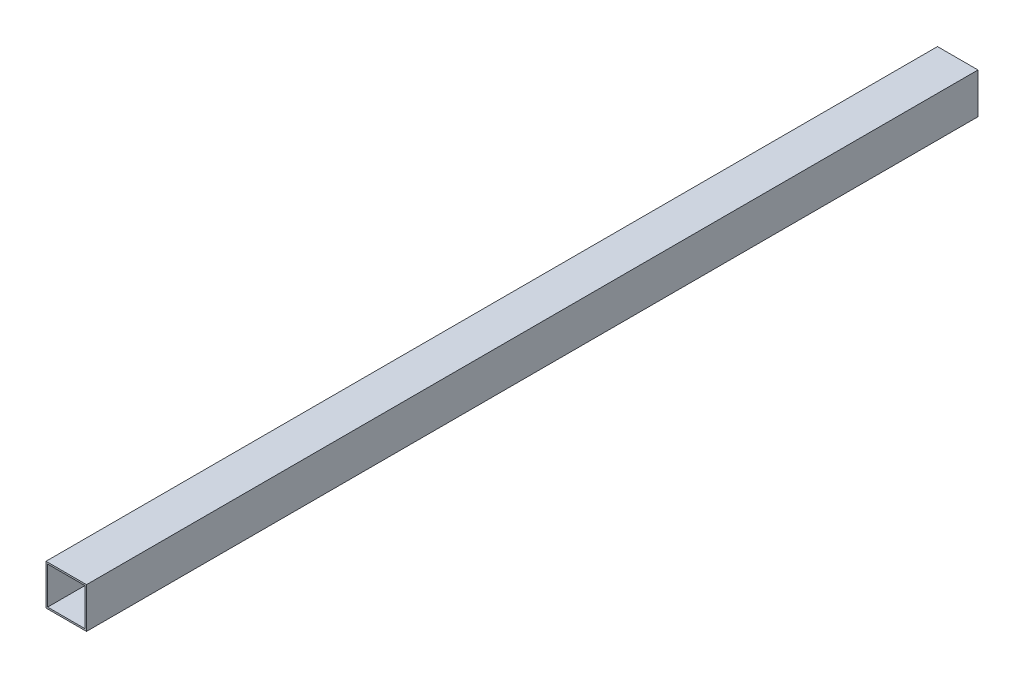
ISO-10303-21;
HEADER;
FILE_DESCRIPTION(('STEP AP214'),'2;1');
FILE_NAME('part.step','',(''),(''),'','','');
FILE_SCHEMA(('AUTOMOTIVE_DESIGN { 1 0 10303 214 1 1 1 1 }'));
ENDSEC;
DATA;
#1=APPLICATION_CONTEXT('core data for automotive mechanical design processes');
#2=APPLICATION_PROTOCOL_DEFINITION('international standard','automotive_design',2000,#1);
#3=PRODUCT_CONTEXT('',#1,'mechanical');
#4=PRODUCT('Part','Part','',(#3));
#5=PRODUCT_RELATED_PRODUCT_CATEGORY('part','',(#4));
#6=PRODUCT_DEFINITION_FORMATION('','',#4);
#7=PRODUCT_DEFINITION_CONTEXT('part definition',#1,'design');
#8=PRODUCT_DEFINITION('design','',#6,#7);
#9=PRODUCT_DEFINITION_SHAPE('','',#8);
#10=(LENGTH_UNIT() NAMED_UNIT(*) SI_UNIT(.MILLI.,.METRE.));
#11=(NAMED_UNIT(*) PLANE_ANGLE_UNIT() SI_UNIT($,.RADIAN.));
#12=(NAMED_UNIT(*) SI_UNIT($,.STERADIAN.) SOLID_ANGLE_UNIT());
#13=UNCERTAINTY_MEASURE_WITH_UNIT(LENGTH_MEASURE(1.E-05),#10,'distance_accuracy_value','');
#14=(GEOMETRIC_REPRESENTATION_CONTEXT(3) GLOBAL_UNCERTAINTY_ASSIGNED_CONTEXT((#13)) GLOBAL_UNIT_ASSIGNED_CONTEXT((#10,
#11,#12)) REPRESENTATION_CONTEXT('',''));
#15=CARTESIAN_POINT('',(0.,0.,0.));
#16=DIRECTION('',(0.,0.,1.));
#17=DIRECTION('',(1.,0.,0.));
#18=AXIS2_PLACEMENT_3D('',#15,#16,#17);
#19=CARTESIAN_POINT('',(0.,0.,1100.));
#20=DIRECTION('',(0.,0.,1.));
#21=DIRECTION('',(1.,0.,0.));
#22=AXIS2_PLACEMENT_3D('',#19,#20,#21);
#23=PLANE('',#22);
#24=DIRECTION('',(0.,1.,0.));
#25=VECTOR('',#24,1.);
#26=CARTESIAN_POINT('',(25.,-25.,1100.));
#27=LINE('',#26,#25);
#28=CARTESIAN_POINT('',(25.,-25.,1100.));
#29=VERTEX_POINT('',#28);
#30=CARTESIAN_POINT('',(25.,25.,1100.));
#31=VERTEX_POINT('',#30);
#32=EDGE_CURVE('E164',#29,#31,#27,.T.);
#33=ORIENTED_EDGE('',*,*,#32,.T.);
#34=DIRECTION('',(-1.,0.,0.));
#35=VECTOR('',#34,1.);
#36=CARTESIAN_POINT('',(-25.,25.,1100.));
#37=LINE('',#36,#35);
#38=CARTESIAN_POINT('',(-25.,25.,1100.));
#39=VERTEX_POINT('',#38);
#40=EDGE_CURVE('E167',#31,#39,#37,.T.);
#41=ORIENTED_EDGE('',*,*,#40,.T.);
#42=DIRECTION('',(0.,-1.,0.));
#43=VECTOR('',#42,1.);
#44=CARTESIAN_POINT('',(-25.,-25.,1100.));
#45=LINE('',#44,#43);
#46=CARTESIAN_POINT('',(-25.,-25.,1100.));
#47=VERTEX_POINT('',#46);
#48=EDGE_CURVE('E170',#39,#47,#45,.T.);
#49=ORIENTED_EDGE('',*,*,#48,.T.);
#50=DIRECTION('',(1.,0.,0.));
#51=VECTOR('',#50,1.);
#52=CARTESIAN_POINT('',(-25.,-25.,1100.));
#53=LINE('',#52,#51);
#54=EDGE_CURVE('E172',#47,#29,#53,.T.);
#55=ORIENTED_EDGE('',*,*,#54,.T.);
#56=EDGE_LOOP('',(#33,#41,#49,#55));
#57=FACE_BOUND('',#56,.T.);
#58=DIRECTION('',(-1.,0.,0.));
#59=VECTOR('',#58,1.);
#60=CARTESIAN_POINT('',(0.,23.,1100.));
#61=LINE('',#60,#59);
#62=CARTESIAN_POINT('',(23.,23.,1100.));
#63=VERTEX_POINT('',#62);
#64=CARTESIAN_POINT('',(-23.,23.,1100.));
#65=VERTEX_POINT('',#64);
#66=EDGE_CURVE('E136',#63,#65,#61,.T.);
#67=ORIENTED_EDGE('',*,*,#66,.F.);
#68=DIRECTION('',(0.,1.,0.));
#69=VECTOR('',#68,1.);
#70=CARTESIAN_POINT('',(23.,0.,1100.));
#71=LINE('',#70,#69);
#72=CARTESIAN_POINT('',(23.,-23.,1100.));
#73=VERTEX_POINT('',#72);
#74=EDGE_CURVE('E128',#73,#63,#71,.T.);
#75=ORIENTED_EDGE('',*,*,#74,.F.);
#76=DIRECTION('',(1.,0.,0.));
#77=VECTOR('',#76,1.);
#78=CARTESIAN_POINT('',(0.,-23.,1100.));
#79=LINE('',#78,#77);
#80=CARTESIAN_POINT('',(-23.,-23.,1100.));
#81=VERTEX_POINT('',#80);
#82=EDGE_CURVE('E150',#81,#73,#79,.T.);
#83=ORIENTED_EDGE('',*,*,#82,.F.);
#84=DIRECTION('',(0.,-1.,0.));
#85=VECTOR('',#84,1.);
#86=CARTESIAN_POINT('',(-23.,0.,1100.));
#87=LINE('',#86,#85);
#88=EDGE_CURVE('E148',#65,#81,#87,.T.);
#89=ORIENTED_EDGE('',*,*,#88,.F.);
#90=EDGE_LOOP('',(#67,#75,#83,#89));
#91=FACE_BOUND('',#90,.T.);
#92=ADVANCED_FACE('F63',(#57,#91),#23,.T.);
#93=CARTESIAN_POINT('',(0.,0.,0.));
#94=DIRECTION('',(0.,0.,1.));
#95=DIRECTION('',(1.,0.,0.));
#96=AXIS2_PLACEMENT_3D('',#93,#94,#95);
#97=PLANE('',#96);
#98=DIRECTION('',(0.,1.,0.));
#99=VECTOR('',#98,1.);
#100=CARTESIAN_POINT('',(25.,-25.,0.));
#101=LINE('',#100,#99);
#102=CARTESIAN_POINT('',(25.,-25.,0.));
#103=VERTEX_POINT('',#102);
#104=CARTESIAN_POINT('',(25.,25.,0.));
#105=VERTEX_POINT('',#104);
#106=EDGE_CURVE('E144',#103,#105,#101,.T.);
#107=ORIENTED_EDGE('',*,*,#106,.F.);
#108=DIRECTION('',(1.,0.,0.));
#109=VECTOR('',#108,1.);
#110=CARTESIAN_POINT('',(-25.,-25.,0.));
#111=LINE('',#110,#109);
#112=CARTESIAN_POINT('',(-25.,-25.,0.));
#113=VERTEX_POINT('',#112);
#114=EDGE_CURVE('E168',#113,#103,#111,.T.);
#115=ORIENTED_EDGE('',*,*,#114,.F.);
#116=DIRECTION('',(0.,-1.,0.));
#117=VECTOR('',#116,1.);
#118=CARTESIAN_POINT('',(-25.,-25.,0.));
#119=LINE('',#118,#117);
#120=CARTESIAN_POINT('',(-25.,25.,0.));
#121=VERTEX_POINT('',#120);
#122=EDGE_CURVE('E179',#121,#113,#119,.T.);
#123=ORIENTED_EDGE('',*,*,#122,.F.);
#124=DIRECTION('',(-1.,0.,0.));
#125=VECTOR('',#124,1.);
#126=CARTESIAN_POINT('',(-25.,25.,0.));
#127=LINE('',#126,#125);
#128=EDGE_CURVE('E177',#105,#121,#127,.T.);
#129=ORIENTED_EDGE('',*,*,#128,.F.);
#130=EDGE_LOOP('',(#107,#115,#123,#129));
#131=FACE_BOUND('',#130,.T.);
#132=DIRECTION('',(0.,1.,0.));
#133=VECTOR('',#132,1.);
#134=CARTESIAN_POINT('',(23.,0.,0.));
#135=LINE('',#134,#133);
#136=CARTESIAN_POINT('',(23.,-23.,0.));
#137=VERTEX_POINT('',#136);
#138=CARTESIAN_POINT('',(23.,23.,0.));
#139=VERTEX_POINT('',#138);
#140=EDGE_CURVE('E86',#137,#139,#135,.T.);
#141=ORIENTED_EDGE('',*,*,#140,.T.);
#142=DIRECTION('',(-1.,0.,0.));
#143=VECTOR('',#142,1.);
#144=CARTESIAN_POINT('',(0.,23.,0.));
#145=LINE('',#144,#143);
#146=CARTESIAN_POINT('',(-23.,23.,0.));
#147=VERTEX_POINT('',#146);
#148=EDGE_CURVE('E143',#139,#147,#145,.T.);
#149=ORIENTED_EDGE('',*,*,#148,.T.);
#150=DIRECTION('',(0.,-1.,0.));
#151=VECTOR('',#150,1.);
#152=CARTESIAN_POINT('',(-23.,0.,0.));
#153=LINE('',#152,#151);
#154=CARTESIAN_POINT('',(-23.,-23.,0.));
#155=VERTEX_POINT('',#154);
#156=EDGE_CURVE('E156',#147,#155,#153,.T.);
#157=ORIENTED_EDGE('',*,*,#156,.T.);
#158=DIRECTION('',(1.,0.,0.));
#159=VECTOR('',#158,1.);
#160=CARTESIAN_POINT('',(0.,-23.,0.));
#161=LINE('',#160,#159);
#162=EDGE_CURVE('E137',#155,#137,#161,.T.);
#163=ORIENTED_EDGE('',*,*,#162,.T.);
#164=EDGE_LOOP('',(#141,#149,#157,#163));
#165=FACE_BOUND('',#164,.T.);
#166=ADVANCED_FACE('F197',(#131,#165),#97,.F.);
#167=CARTESIAN_POINT('',(25.,-25.,1100.));
#168=DIRECTION('',(-1.,0.,0.));
#169=DIRECTION('',(0.,0.,1.));
#170=AXIS2_PLACEMENT_3D('',#167,#168,#169);
#171=PLANE('',#170);
#172=ORIENTED_EDGE('',*,*,#106,.T.);
#173=DIRECTION('',(0.,0.,-1.));
#174=VECTOR('',#173,1.);
#175=CARTESIAN_POINT('',(25.,25.,1100.));
#176=LINE('',#175,#174);
#177=EDGE_CURVE('E12',#31,#105,#176,.T.);
#178=ORIENTED_EDGE('',*,*,#177,.F.);
#179=ORIENTED_EDGE('',*,*,#32,.F.);
#180=DIRECTION('',(0.,0.,-1.));
#181=VECTOR('',#180,1.);
#182=CARTESIAN_POINT('',(25.,-25.,1100.));
#183=LINE('',#182,#181);
#184=EDGE_CURVE('E174',#29,#103,#183,.T.);
#185=ORIENTED_EDGE('',*,*,#184,.T.);
#186=EDGE_LOOP('',(#172,#178,#179,#185));
#187=FACE_BOUND('',#186,.T.);
#188=ADVANCED_FACE('F65',(#187),#171,.F.);
#189=CARTESIAN_POINT('',(-25.,25.,1100.));
#190=DIRECTION('',(0.,-1.,0.));
#191=DIRECTION('',(0.,0.,-1.));
#192=AXIS2_PLACEMENT_3D('',#189,#190,#191);
#193=PLANE('',#192);
#194=ORIENTED_EDGE('',*,*,#128,.T.);
#195=DIRECTION('',(0.,0.,-1.));
#196=VECTOR('',#195,1.);
#197=CARTESIAN_POINT('',(-25.,25.,1100.));
#198=LINE('',#197,#196);
#199=EDGE_CURVE('E71',#39,#121,#198,.T.);
#200=ORIENTED_EDGE('',*,*,#199,.F.);
#201=ORIENTED_EDGE('',*,*,#40,.F.);
#202=ORIENTED_EDGE('',*,*,#177,.T.);
#203=EDGE_LOOP('',(#194,#200,#201,#202));
#204=FACE_BOUND('',#203,.T.);
#205=ADVANCED_FACE('F207',(#204),#193,.F.);
#206=CARTESIAN_POINT('',(-25.,-25.,1100.));
#207=DIRECTION('',(1.,0.,0.));
#208=DIRECTION('',(0.,0.,-1.));
#209=AXIS2_PLACEMENT_3D('',#206,#207,#208);
#210=PLANE('',#209);
#211=ORIENTED_EDGE('',*,*,#122,.T.);
#212=DIRECTION('',(0.,0.,-1.));
#213=VECTOR('',#212,1.);
#214=CARTESIAN_POINT('',(-25.,-25.,1100.));
#215=LINE('',#214,#213);
#216=EDGE_CURVE('E184',#47,#113,#215,.T.);
#217=ORIENTED_EDGE('',*,*,#216,.F.);
#218=ORIENTED_EDGE('',*,*,#48,.F.);
#219=ORIENTED_EDGE('',*,*,#199,.T.);
#220=EDGE_LOOP('',(#211,#217,#218,#219));
#221=FACE_BOUND('',#220,.T.);
#222=ADVANCED_FACE('F191',(#221),#210,.F.);
#223=CARTESIAN_POINT('',(-25.,-25.,1100.));
#224=DIRECTION('',(0.,1.,0.));
#225=DIRECTION('',(0.,0.,1.));
#226=AXIS2_PLACEMENT_3D('',#223,#224,#225);
#227=PLANE('',#226);
#228=ORIENTED_EDGE('',*,*,#114,.T.);
#229=ORIENTED_EDGE('',*,*,#184,.F.);
#230=ORIENTED_EDGE('',*,*,#54,.F.);
#231=ORIENTED_EDGE('',*,*,#216,.T.);
#232=EDGE_LOOP('',(#228,#229,#230,#231));
#233=FACE_BOUND('',#232,.T.);
#234=ADVANCED_FACE('F201',(#233),#227,.F.);
#235=CARTESIAN_POINT('',(23.,0.,1100.));
#236=DIRECTION('',(-1.,0.,0.));
#237=DIRECTION('',(0.,0.,1.));
#238=AXIS2_PLACEMENT_3D('',#235,#236,#237);
#239=PLANE('',#238);
#240=ORIENTED_EDGE('',*,*,#140,.F.);
#241=DIRECTION('',(0.,0.,-1.));
#242=VECTOR('',#241,1.);
#243=CARTESIAN_POINT('',(23.,-23.,1100.));
#244=LINE('',#243,#242);
#245=EDGE_CURVE('E132',#73,#137,#244,.T.);
#246=ORIENTED_EDGE('',*,*,#245,.F.);
#247=ORIENTED_EDGE('',*,*,#74,.T.);
#248=DIRECTION('',(0.,0.,-1.));
#249=VECTOR('',#248,1.);
#250=CARTESIAN_POINT('',(23.,23.,1100.));
#251=LINE('',#250,#249);
#252=EDGE_CURVE('E131',#63,#139,#251,.T.);
#253=ORIENTED_EDGE('',*,*,#252,.T.);
#254=EDGE_LOOP('',(#240,#246,#247,#253));
#255=FACE_BOUND('',#254,.T.);
#256=ADVANCED_FACE('F130',(#255),#239,.T.);
#257=CARTESIAN_POINT('',(0.,23.,1100.));
#258=DIRECTION('',(0.,-1.,0.));
#259=DIRECTION('',(0.,0.,-1.));
#260=AXIS2_PLACEMENT_3D('',#257,#258,#259);
#261=PLANE('',#260);
#262=ORIENTED_EDGE('',*,*,#148,.F.);
#263=ORIENTED_EDGE('',*,*,#252,.F.);
#264=ORIENTED_EDGE('',*,*,#66,.T.);
#265=DIRECTION('',(0.,0.,-1.));
#266=VECTOR('',#265,1.);
#267=CARTESIAN_POINT('',(-23.,23.,1100.));
#268=LINE('',#267,#266);
#269=EDGE_CURVE('E145',#65,#147,#268,.T.);
#270=ORIENTED_EDGE('',*,*,#269,.T.);
#271=EDGE_LOOP('',(#262,#263,#264,#270));
#272=FACE_BOUND('',#271,.T.);
#273=ADVANCED_FACE('F140',(#272),#261,.T.);
#274=CARTESIAN_POINT('',(-23.,0.,1100.));
#275=DIRECTION('',(1.,0.,0.));
#276=DIRECTION('',(0.,0.,-1.));
#277=AXIS2_PLACEMENT_3D('',#274,#275,#276);
#278=PLANE('',#277);
#279=ORIENTED_EDGE('',*,*,#156,.F.);
#280=ORIENTED_EDGE('',*,*,#269,.F.);
#281=ORIENTED_EDGE('',*,*,#88,.T.);
#282=DIRECTION('',(0.,0.,-1.));
#283=VECTOR('',#282,1.);
#284=CARTESIAN_POINT('',(-23.,-23.,1100.));
#285=LINE('',#284,#283);
#286=EDGE_CURVE('E78',#81,#155,#285,.T.);
#287=ORIENTED_EDGE('',*,*,#286,.T.);
#288=EDGE_LOOP('',(#279,#280,#281,#287));
#289=FACE_BOUND('',#288,.T.);
#290=ADVANCED_FACE('F230',(#289),#278,.T.);
#291=CARTESIAN_POINT('',(0.,-23.,1100.));
#292=DIRECTION('',(0.,1.,0.));
#293=DIRECTION('',(0.,0.,1.));
#294=AXIS2_PLACEMENT_3D('',#291,#292,#293);
#295=PLANE('',#294);
#296=ORIENTED_EDGE('',*,*,#162,.F.);
#297=ORIENTED_EDGE('',*,*,#286,.F.);
#298=ORIENTED_EDGE('',*,*,#82,.T.);
#299=ORIENTED_EDGE('',*,*,#245,.T.);
#300=EDGE_LOOP('',(#296,#297,#298,#299));
#301=FACE_BOUND('',#300,.T.);
#302=ADVANCED_FACE('F234',(#301),#295,.T.);
#303=CLOSED_SHELL('',(#92,#166,#188,#205,#222,#234,#256,#273,#290,#302));
#304=MANIFOLD_SOLID_BREP('B2',#303);
#305=ADVANCED_BREP_SHAPE_REPRESENTATION('',(#18,#304),#14);
#306=SHAPE_DEFINITION_REPRESENTATION(#9,#305);
ENDSEC;
END-ISO-10303-21;
